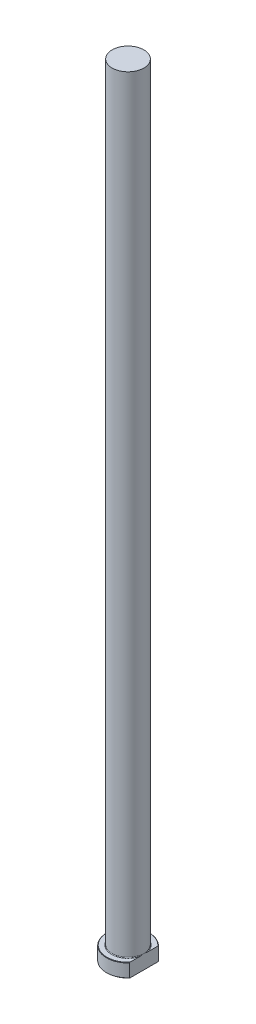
ISO-10303-21;
HEADER;
FILE_DESCRIPTION(('STEP AP214'),'2;1');
FILE_NAME('part.step','',(''),(''),'','','');
FILE_SCHEMA(('AUTOMOTIVE_DESIGN { 1 0 10303 214 1 1 1 1 }'));
ENDSEC;
DATA;
#1=APPLICATION_CONTEXT('core data for automotive mechanical design processes');
#2=APPLICATION_PROTOCOL_DEFINITION('international standard','automotive_design',2000,#1);
#3=PRODUCT_CONTEXT('',#1,'mechanical');
#4=PRODUCT('Part','Part','',(#3));
#5=PRODUCT_RELATED_PRODUCT_CATEGORY('part','',(#4));
#6=PRODUCT_DEFINITION_FORMATION('','',#4);
#7=PRODUCT_DEFINITION_CONTEXT('part definition',#1,'design');
#8=PRODUCT_DEFINITION('design','',#6,#7);
#9=PRODUCT_DEFINITION_SHAPE('','',#8);
#10=(LENGTH_UNIT() NAMED_UNIT(*) SI_UNIT(.MILLI.,.METRE.));
#11=(NAMED_UNIT(*) PLANE_ANGLE_UNIT() SI_UNIT($,.RADIAN.));
#12=(NAMED_UNIT(*) SI_UNIT($,.STERADIAN.) SOLID_ANGLE_UNIT());
#13=UNCERTAINTY_MEASURE_WITH_UNIT(LENGTH_MEASURE(1.E-05),#10,'distance_accuracy_value','');
#14=(GEOMETRIC_REPRESENTATION_CONTEXT(3) GLOBAL_UNCERTAINTY_ASSIGNED_CONTEXT((#13)) GLOBAL_UNIT_ASSIGNED_CONTEXT((#10,
#11,#12)) REPRESENTATION_CONTEXT('',''));
#15=CARTESIAN_POINT('',(0.,0.,0.));
#16=DIRECTION('',(0.,0.,1.));
#17=DIRECTION('',(1.,0.,0.));
#18=AXIS2_PLACEMENT_3D('',#15,#16,#17);
#19=CARTESIAN_POINT('',(0.,0.,0.));
#20=DIRECTION('',(0.,-1.,0.));
#21=DIRECTION('',(0.,0.,-1.));
#22=AXIS2_PLACEMENT_3D('',#19,#20,#21);
#23=PLANE('',#22);
#24=CARTESIAN_POINT('',(0.,0.,0.));
#25=DIRECTION('',(0.,-1.,0.));
#26=DIRECTION('',(0.,0.,-1.));
#27=AXIS2_PLACEMENT_3D('',#24,#25,#26);
#28=CIRCLE('',#27,10.7999999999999);
#29=CARTESIAN_POINT('',(8.09999999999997,0.,7.14352853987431));
#30=VERTEX_POINT('',#29);
#31=CARTESIAN_POINT('',(8.09999999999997,0.,-7.14352853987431));
#32=VERTEX_POINT('',#31);
#33=EDGE_CURVE('E98',#30,#32,#28,.T.);
#34=ORIENTED_EDGE('',*,*,#33,.T.);
#35=DIRECTION('',(0.,0.,1.));
#36=VECTOR('',#35,1.);
#37=CARTESIAN_POINT('',(8.09999999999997,0.,-7.44244583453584));
#38=LINE('',#37,#36);
#39=EDGE_CURVE('E83',#32,#30,#38,.T.);
#40=ORIENTED_EDGE('',*,*,#39,.T.);
#41=EDGE_LOOP('',(#34,#40));
#42=FACE_BOUND('',#41,.T.);
#43=ADVANCED_FACE('F32',(#42),#23,.T.);
#44=CARTESIAN_POINT('',(0.,259.958771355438,0.));
#45=DIRECTION('',(0.,1.,0.));
#46=DIRECTION('',(0.,0.,1.));
#47=AXIS2_PLACEMENT_3D('',#44,#45,#46);
#48=CYLINDRICAL_SURFACE('',#47,11.);
#49=CARTESIAN_POINT('',(0.,6.79999999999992,0.));
#50=DIRECTION('',(0.,1.,0.));
#51=DIRECTION('',(0.,0.,1.));
#52=AXIS2_PLACEMENT_3D('',#49,#50,#51);
#53=CIRCLE('',#52,11.);
#54=CARTESIAN_POINT('',(8.09999999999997,6.79999999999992,7.44244583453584));
#55=VERTEX_POINT('',#54);
#56=CARTESIAN_POINT('',(8.09999999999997,6.79999999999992,-7.44244583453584));
#57=VERTEX_POINT('',#56);
#58=EDGE_CURVE('E104',#55,#57,#53,.F.);
#59=ORIENTED_EDGE('',*,*,#58,.T.);
#60=DIRECTION('',(0.,-1.,0.));
#61=VECTOR('',#60,1.);
#62=CARTESIAN_POINT('',(8.09999999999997,400.,-7.44244583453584));
#63=LINE('',#62,#61);
#64=CARTESIAN_POINT('',(8.09999999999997,0.200000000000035,-7.44244583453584));
#65=VERTEX_POINT('',#64);
#66=EDGE_CURVE('E183',#57,#65,#63,.T.);
#67=ORIENTED_EDGE('',*,*,#66,.T.);
#68=CARTESIAN_POINT('',(0.,0.200000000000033,0.));
#69=DIRECTION('',(0.,-1.,0.));
#70=DIRECTION('',(0.,0.,-1.));
#71=AXIS2_PLACEMENT_3D('',#68,#69,#70);
#72=CIRCLE('',#71,11.);
#73=CARTESIAN_POINT('',(8.09999999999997,0.200000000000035,7.44244583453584));
#74=VERTEX_POINT('',#73);
#75=EDGE_CURVE('E100',#65,#74,#72,.F.);
#76=ORIENTED_EDGE('',*,*,#75,.T.);
#77=DIRECTION('',(0.,-1.,0.));
#78=VECTOR('',#77,1.);
#79=CARTESIAN_POINT('',(8.09999999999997,400.,7.44244583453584));
#80=LINE('',#79,#78);
#81=EDGE_CURVE('E93',#55,#74,#80,.T.);
#82=ORIENTED_EDGE('',*,*,#81,.F.);
#83=EDGE_LOOP('',(#59,#67,#76,#82));
#84=FACE_BOUND('',#83,.T.);
#85=ADVANCED_FACE('F158',(#84),#48,.T.);
#86=CARTESIAN_POINT('',(-11.,7.,0.));
#87=DIRECTION('',(0.,1.,0.));
#88=DIRECTION('',(0.,0.,1.));
#89=AXIS2_PLACEMENT_3D('',#86,#87,#88);
#90=PLANE('',#89);
#91=CARTESIAN_POINT('',(0.,7.,0.));
#92=DIRECTION('',(0.,1.,0.));
#93=DIRECTION('',(0.,0.,1.));
#94=AXIS2_PLACEMENT_3D('',#91,#92,#93);
#95=CIRCLE('',#94,10.7999999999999);
#96=CARTESIAN_POINT('',(8.09999999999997,7.,-7.14352853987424));
#97=VERTEX_POINT('',#96);
#98=CARTESIAN_POINT('',(8.09999999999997,7.,7.14352853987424));
#99=VERTEX_POINT('',#98);
#100=EDGE_CURVE('E178',#97,#99,#95,.T.);
#101=ORIENTED_EDGE('',*,*,#100,.T.);
#102=DIRECTION('',(0.,0.,-1.));
#103=VECTOR('',#102,1.);
#104=CARTESIAN_POINT('',(8.09999999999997,7.,0.));
#105=LINE('',#104,#103);
#106=CARTESIAN_POINT('',(8.09999999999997,6.99999999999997,2.22485954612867));
#107=VERTEX_POINT('',#106);
#108=EDGE_CURVE('E57',#99,#107,#105,.T.);
#109=ORIENTED_EDGE('',*,*,#108,.T.);
#110=CARTESIAN_POINT('',(0.,7.,0.));
#111=DIRECTION('',(0.,1.,0.));
#112=DIRECTION('',(0.,0.,1.));
#113=AXIS2_PLACEMENT_3D('',#110,#111,#112);
#114=CIRCLE('',#113,8.39999999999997);
#115=CARTESIAN_POINT('',(8.09999999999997,6.99999999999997,-2.22485954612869));
#116=VERTEX_POINT('',#115);
#117=EDGE_CURVE('E107',#107,#116,#114,.F.);
#118=ORIENTED_EDGE('',*,*,#117,.T.);
#119=EDGE_CURVE('E136',#116,#97,#105,.T.);
#120=ORIENTED_EDGE('',*,*,#119,.T.);
#121=EDGE_LOOP('',(#101,#109,#118,#120));
#122=FACE_BOUND('',#121,.T.);
#123=ADVANCED_FACE('F147',(#122),#90,.T.);
#124=CARTESIAN_POINT('',(0.,7.00000000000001,0.));
#125=DIRECTION('',(0.,-1.,0.));
#126=DIRECTION('',(0.,0.,-1.));
#127=AXIS2_PLACEMENT_3D('',#124,#125,#126);
#128=CONICAL_SURFACE('',#127,10.7999999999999,0.785398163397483);
#129=ORIENTED_EDGE('',*,*,#58,.F.);
#130=CARTESIAN_POINT('',(8.09999999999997,-0.468293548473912,16.3743869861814));
#131=CARTESIAN_POINT('',(8.09999999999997,-0.254363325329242,16.1357074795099));
#132=CARTESIAN_POINT('',(8.09999999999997,-0.0409370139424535,15.8965760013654));
#133=CARTESIAN_POINT('',(8.09999999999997,0.384762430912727,15.417284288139));
#134=CARTESIAN_POINT('',(8.09999999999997,0.597035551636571,15.1771240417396));
#135=CARTESIAN_POINT('',(8.09999999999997,1.23203735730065,14.4547646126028));
#136=CARTESIAN_POINT('',(8.09999999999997,1.65280946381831,13.9708414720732));
#137=CARTESIAN_POINT('',(8.09999999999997,2.49198203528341,12.9919134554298));
#138=CARTESIAN_POINT('',(8.09999999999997,2.91030911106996,12.4968454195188));
#139=CARTESIAN_POINT('',(8.09999999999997,3.53063151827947,11.7483710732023));
#140=CARTESIAN_POINT('',(8.09999999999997,3.73619473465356,11.4979212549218));
#141=CARTESIAN_POINT('',(8.09999999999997,4.14450356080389,10.9947372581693));
#142=CARTESIAN_POINT('',(8.09999999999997,4.3472492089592,10.7420031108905));
#143=CARTESIAN_POINT('',(8.09999999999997,4.73433340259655,10.2529152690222));
#144=CARTESIAN_POINT('',(8.09999999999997,4.91891315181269,10.0167526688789));
#145=CARTESIAN_POINT('',(8.09999999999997,5.28467709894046,9.54181650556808));
#146=CARTESIAN_POINT('',(8.09999999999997,5.4658613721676,9.30304300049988));
#147=CARTESIAN_POINT('',(8.09999999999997,5.82427381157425,8.8223405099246));
#148=CARTESIAN_POINT('',(8.09999999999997,6.00149981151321,8.58040990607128));
#149=CARTESIAN_POINT('',(8.09999999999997,6.35105499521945,8.0930332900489));
#150=CARTESIAN_POINT('',(8.09999999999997,6.52338425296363,7.84758733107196));
#151=CARTESIAN_POINT('',(8.09999999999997,6.86170981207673,7.35313784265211));
#152=CARTESIAN_POINT('',(8.09999999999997,7.02771904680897,7.10414319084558));
#153=CARTESIAN_POINT('',(8.09999999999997,7.35243924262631,6.6013915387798));
#154=CARTESIAN_POINT('',(8.09999999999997,7.51114961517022,6.34763415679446));
#155=CARTESIAN_POINT('',(8.09999999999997,7.81934238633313,5.83485140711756));
#156=CARTESIAN_POINT('',(8.09999999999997,7.96883276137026,5.57583085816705));
#157=CARTESIAN_POINT('',(8.09999999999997,8.25640202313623,5.05156426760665));
#158=CARTESIAN_POINT('',(8.09999999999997,8.39448364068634,4.7863197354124));
#159=CARTESIAN_POINT('',(8.09999999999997,8.64733540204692,4.26720676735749));
#160=CARTESIAN_POINT('',(8.09999999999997,8.76305451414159,4.01380392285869));
#161=CARTESIAN_POINT('',(8.09999999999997,8.97906757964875,3.50043611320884));
#162=CARTESIAN_POINT('',(8.09999999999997,9.07936141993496,3.24047109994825));
#163=CARTESIAN_POINT('',(8.09999999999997,9.26061269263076,2.71507213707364));
#164=CARTESIAN_POINT('',(8.09999999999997,9.34165272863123,2.4496670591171));
#165=CARTESIAN_POINT('',(8.09999999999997,9.48121180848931,1.91293243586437));
#166=CARTESIAN_POINT('',(8.09999999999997,9.53973286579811,1.64160342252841));
#167=CARTESIAN_POINT('',(8.09999999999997,9.63162156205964,1.08977238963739));
#168=CARTESIAN_POINT('',(8.09999999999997,9.66453368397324,0.809192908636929));
#169=CARTESIAN_POINT('',(8.09999999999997,9.70112845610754,0.246139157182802));
#170=CARTESIAN_POINT('',(8.09999999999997,9.70481576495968,-0.0363348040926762));
#171=CARTESIAN_POINT('',(8.09999999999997,9.68267265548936,-0.600479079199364));
#172=CARTESIAN_POINT('',(8.09999999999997,9.6568027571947,-0.882147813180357));
#173=CARTESIAN_POINT('',(8.09999999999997,9.57739238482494,-1.44154939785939));
#174=CARTESIAN_POINT('',(8.09999999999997,9.52384373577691,-1.71928106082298));
#175=CARTESIAN_POINT('',(8.09999999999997,9.37717365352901,-2.3328661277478));
#176=CARTESIAN_POINT('',(8.09999999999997,9.27774098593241,-2.66719445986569));
#177=CARTESIAN_POINT('',(8.09999999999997,9.04935963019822,-3.32555561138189));
#178=CARTESIAN_POINT('',(8.09999999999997,8.92039733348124,-3.64958360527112));
#179=CARTESIAN_POINT('',(8.09999999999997,8.7090765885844,-4.12987142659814));
#180=CARTESIAN_POINT('',(8.09999999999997,8.63516457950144,-4.28993932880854));
#181=CARTESIAN_POINT('',(8.09999999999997,8.48223226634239,-4.60762322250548));
#182=CARTESIAN_POINT('',(8.09999999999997,8.40321193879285,-4.76523920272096));
#183=CARTESIAN_POINT('',(8.09999999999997,8.24075032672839,-5.07810202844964));
#184=CARTESIAN_POINT('',(8.09999999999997,8.15731046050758,-5.23334961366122));
#185=CARTESIAN_POINT('',(8.09999999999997,7.98654878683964,-5.54168695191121));
#186=CARTESIAN_POINT('',(8.09999999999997,7.89922702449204,-5.69477672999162));
#187=CARTESIAN_POINT('',(8.09999999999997,7.66338960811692,-6.09772881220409));
#188=CARTESIAN_POINT('',(8.09999999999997,7.51195498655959,-6.34588392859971));
#189=CARTESIAN_POINT('',(8.09999999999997,7.20164049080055,-6.83751069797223));
#190=CARTESIAN_POINT('',(8.09999999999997,7.04275963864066,-7.08098172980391));
#191=CARTESIAN_POINT('',(8.09999999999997,6.71886431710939,-7.56397194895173));
#192=CARTESIAN_POINT('',(8.09999999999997,6.55384686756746,-7.80348913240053));
#193=CARTESIAN_POINT('',(8.09999999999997,6.21883875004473,-8.27899456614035));
#194=CARTESIAN_POINT('',(8.09999999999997,6.04884829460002,-8.51498296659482));
#195=CARTESIAN_POINT('',(8.09999999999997,5.70426867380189,-8.98455504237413));
#196=CARTESIAN_POINT('',(8.09999999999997,5.52966831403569,-9.21813048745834));
#197=CARTESIAN_POINT('',(8.09999999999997,5.17697958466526,-9.68263613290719));
#198=CARTESIAN_POINT('',(8.09999999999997,4.99889113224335,-9.91356627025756));
#199=CARTESIAN_POINT('',(8.09999999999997,4.46033384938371,-10.6027922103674));
#200=CARTESIAN_POINT('',(8.09999999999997,4.09547364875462,-11.0576577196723));
#201=CARTESIAN_POINT('',(8.09999999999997,3.38639212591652,-11.9247254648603));
#202=CARTESIAN_POINT('',(8.09999999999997,3.04281718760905,-12.3374594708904));
#203=CARTESIAN_POINT('',(8.09999999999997,2.3500551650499,-13.1582374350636));
#204=CARTESIAN_POINT('',(8.09999999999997,2.00086766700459,-13.5662810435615));
#205=CARTESIAN_POINT('',(8.09999999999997,1.30027764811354,-14.3760884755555));
#206=CARTESIAN_POINT('',(8.09999999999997,0.948901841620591,-14.7778754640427));
#207=CARTESIAN_POINT('',(8.09999999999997,0.242699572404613,-15.5783083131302));
#208=CARTESIAN_POINT('',(8.09999999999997,-0.112126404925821,-15.9769546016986));
#209=CARTESIAN_POINT('',(8.09999999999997,-0.468293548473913,-16.3743869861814));
#210=B_SPLINE_CURVE_WITH_KNOTS('',3,(#130,#131,#132,#133,#134,#135,#136,#137,#138,#139,#140,
#141,#142,#143,#144,#145,#146,#147,#148,#149,#150,#151,#152,#153,#154,#155,#156,#157,#158,#159,
#160,#161,#162,#163,#164,#165,#166,#167,#168,#169,#170,#171,#172,#173,#174,#175,#176,#177,#178,
#179,#180,#181,#182,#183,#184,#185,#186,#187,#188,#189,#190,#191,#192,#193,#194,#195,#196,#197,
#198,#199,#200,#201,#202,#203,#204,#205,#206,#207,#208,#209),.UNSPECIFIED.,.F.,.F.,(4,2,2,2,2,2,
2,2,2,2,2,2,2,2,2,2,2,2,2,2,2,2,2,2,2,2,2,2,2,2,2,2,2,2,2,2,2,2,2,4),(0.,0.961563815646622,
1.92313823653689,3.84691108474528,5.79124096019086,6.76324981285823,7.73524541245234,
8.63443178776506,9.53359819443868,10.4332451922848,11.3328785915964,12.2305594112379,
13.128312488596,14.0252776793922,14.9220275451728,15.7573406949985,16.5926599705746,
17.4243280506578,18.2559217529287,19.1019891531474,19.9479216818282,20.7949854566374,
21.6422995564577,22.6869149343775,23.7320126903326,24.2608671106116,24.7897239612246,
25.3184121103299,25.8470941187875,26.7190513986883,27.5911235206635,28.4636248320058,
29.3360889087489,30.2109126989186,31.085757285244,32.8349455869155,34.4459592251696,
36.0570921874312,37.6583452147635,39.2593761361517),.UNSPECIFIED.);
#211=EDGE_CURVE('E135',#55,#99,#210,.T.);
#212=ORIENTED_EDGE('',*,*,#211,.T.);
#213=ORIENTED_EDGE('',*,*,#100,.F.);
#214=EDGE_CURVE('E127',#97,#57,#210,.T.);
#215=ORIENTED_EDGE('',*,*,#214,.T.);
#216=EDGE_LOOP('',(#129,#212,#213,#215));
#217=FACE_BOUND('',#216,.T.);
#218=ADVANCED_FACE('F143',(#217),#128,.T.);
#219=CARTESIAN_POINT('',(0.,0.200000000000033,0.));
#220=DIRECTION('',(0.,1.,0.));
#221=DIRECTION('',(0.,0.,1.));
#222=AXIS2_PLACEMENT_3D('',#219,#220,#221);
#223=CONICAL_SURFACE('',#222,11.,0.785398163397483);
#224=ORIENTED_EDGE('',*,*,#75,.F.);
#225=CARTESIAN_POINT('',(8.09999999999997,7.46829354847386,-16.3743869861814));
#226=CARTESIAN_POINT('',(8.09999999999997,7.25436332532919,-16.1357074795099));
#227=CARTESIAN_POINT('',(8.09999999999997,7.0409370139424,-15.8965760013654));
#228=CARTESIAN_POINT('',(8.09999999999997,6.61523756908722,-15.417284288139));
#229=CARTESIAN_POINT('',(8.09999999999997,6.40296444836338,-15.1771240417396));
#230=CARTESIAN_POINT('',(8.09999999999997,5.7679626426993,-14.4547646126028));
#231=CARTESIAN_POINT('',(8.09999999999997,5.34719053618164,-13.9708414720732));
#232=CARTESIAN_POINT('',(8.09999999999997,4.50801796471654,-12.9919134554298));
#233=CARTESIAN_POINT('',(8.09999999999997,4.08969088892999,-12.4968454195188));
#234=CARTESIAN_POINT('',(8.09999999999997,3.46936848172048,-11.7483710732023));
#235=CARTESIAN_POINT('',(8.09999999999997,3.26380526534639,-11.4979212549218));
#236=CARTESIAN_POINT('',(8.09999999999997,2.85549643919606,-10.9947372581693));
#237=CARTESIAN_POINT('',(8.09999999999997,2.65275079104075,-10.7420031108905));
#238=CARTESIAN_POINT('',(8.09999999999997,2.26566659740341,-10.2529152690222));
#239=CARTESIAN_POINT('',(8.09999999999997,2.08108684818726,-10.0167526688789));
#240=CARTESIAN_POINT('',(8.09999999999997,1.71532290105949,-9.54181650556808));
#241=CARTESIAN_POINT('',(8.09999999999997,1.53413862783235,-9.30304300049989));
#242=CARTESIAN_POINT('',(8.09999999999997,1.1757261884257,-8.8223405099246));
#243=CARTESIAN_POINT('',(8.09999999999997,0.998500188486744,-8.58040990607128));
#244=CARTESIAN_POINT('',(8.09999999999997,0.648945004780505,-8.09303329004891));
#245=CARTESIAN_POINT('',(8.09999999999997,0.476615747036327,-7.84758733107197));
#246=CARTESIAN_POINT('',(8.09999999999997,0.138290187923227,-7.35313784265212));
#247=CARTESIAN_POINT('',(8.09999999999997,-0.0277190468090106,-7.10414319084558));
#248=CARTESIAN_POINT('',(8.09999999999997,-0.352439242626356,-6.60139153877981));
#249=CARTESIAN_POINT('',(8.09999999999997,-0.511149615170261,-6.34763415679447));
#250=CARTESIAN_POINT('',(8.09999999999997,-0.819342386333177,-5.83485140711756));
#251=CARTESIAN_POINT('',(8.09999999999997,-0.968832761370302,-5.57583085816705));
#252=CARTESIAN_POINT('',(8.09999999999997,-1.25640202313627,-5.05156426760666));
#253=CARTESIAN_POINT('',(8.09999999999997,-1.39448364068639,-4.78631973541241));
#254=CARTESIAN_POINT('',(8.09999999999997,-1.64733540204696,-4.26720676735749));
#255=CARTESIAN_POINT('',(8.09999999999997,-1.76305451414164,-4.0138039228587));
#256=CARTESIAN_POINT('',(8.09999999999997,-1.97906757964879,-3.50043611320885));
#257=CARTESIAN_POINT('',(8.09999999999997,-2.079361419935,-3.24047109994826));
#258=CARTESIAN_POINT('',(8.09999999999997,-2.26061269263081,-2.71507213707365));
#259=CARTESIAN_POINT('',(8.09999999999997,-2.34165272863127,-2.44966705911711));
#260=CARTESIAN_POINT('',(8.09999999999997,-2.48121180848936,-1.91293243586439));
#261=CARTESIAN_POINT('',(8.09999999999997,-2.53973286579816,-1.64160342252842));
#262=CARTESIAN_POINT('',(8.09999999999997,-2.63162156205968,-1.0897723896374));
#263=CARTESIAN_POINT('',(8.09999999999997,-2.66453368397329,-0.80919290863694));
#264=CARTESIAN_POINT('',(8.09999999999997,-2.70112845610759,-0.246139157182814));
#265=CARTESIAN_POINT('',(8.09999999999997,-2.70481576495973,0.0363348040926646));
#266=CARTESIAN_POINT('',(8.09999999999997,-2.68267265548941,0.600479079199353));
#267=CARTESIAN_POINT('',(8.09999999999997,-2.65680275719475,0.882147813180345));
#268=CARTESIAN_POINT('',(8.09999999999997,-2.57739238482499,1.44154939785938));
#269=CARTESIAN_POINT('',(8.09999999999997,-2.52384373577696,1.71928106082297));
#270=CARTESIAN_POINT('',(8.09999999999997,-2.37717365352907,2.33286612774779));
#271=CARTESIAN_POINT('',(8.09999999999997,-2.27774098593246,2.66719445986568));
#272=CARTESIAN_POINT('',(8.09999999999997,-2.04935963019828,3.32555561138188));
#273=CARTESIAN_POINT('',(8.09999999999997,-1.92039733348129,3.64958360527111));
#274=CARTESIAN_POINT('',(8.09999999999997,-1.70907658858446,4.12987142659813));
#275=CARTESIAN_POINT('',(8.09999999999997,-1.63516457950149,4.28993932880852));
#276=CARTESIAN_POINT('',(8.09999999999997,-1.48223226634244,4.60762322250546));
#277=CARTESIAN_POINT('',(8.09999999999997,-1.4032119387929,4.76523920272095));
#278=CARTESIAN_POINT('',(8.09999999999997,-1.24075032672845,5.07810202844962));
#279=CARTESIAN_POINT('',(8.09999999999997,-1.15731046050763,5.23334961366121));
#280=CARTESIAN_POINT('',(8.09999999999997,-0.986548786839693,5.5416869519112));
#281=CARTESIAN_POINT('',(8.09999999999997,-0.899227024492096,5.69477672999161));
#282=CARTESIAN_POINT('',(8.09999999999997,-0.663389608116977,6.09772881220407));
#283=CARTESIAN_POINT('',(8.09999999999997,-0.511954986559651,6.3458839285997));
#284=CARTESIAN_POINT('',(8.09999999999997,-0.201640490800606,6.83751069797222));
#285=CARTESIAN_POINT('',(8.09999999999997,-0.0427596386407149,7.0809817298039));
#286=CARTESIAN_POINT('',(8.09999999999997,0.281135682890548,7.56397194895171));
#287=CARTESIAN_POINT('',(8.09999999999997,0.446153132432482,7.80348913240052));
#288=CARTESIAN_POINT('',(8.09999999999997,0.781161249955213,8.27899456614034));
#289=CARTESIAN_POINT('',(8.09999999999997,0.951151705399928,8.51498296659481));
#290=CARTESIAN_POINT('',(8.09999999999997,1.29573132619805,8.98455504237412));
#291=CARTESIAN_POINT('',(8.09999999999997,1.47033168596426,9.21813048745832));
#292=CARTESIAN_POINT('',(8.09999999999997,1.82302041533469,9.68263613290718));
#293=CARTESIAN_POINT('',(8.09999999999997,2.00110886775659,9.91356627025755));
#294=CARTESIAN_POINT('',(8.09999999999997,2.53966615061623,10.6027922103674));
#295=CARTESIAN_POINT('',(8.09999999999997,2.90452635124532,11.0576577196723));
#296=CARTESIAN_POINT('',(8.09999999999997,3.61360787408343,11.9247254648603));
#297=CARTESIAN_POINT('',(8.09999999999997,3.9571828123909,12.3374594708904));
#298=CARTESIAN_POINT('',(8.09999999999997,4.64994483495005,13.1582374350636));
#299=CARTESIAN_POINT('',(8.09999999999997,4.99913233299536,13.5662810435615));
#300=CARTESIAN_POINT('',(8.09999999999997,5.69972235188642,14.3760884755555));
#301=CARTESIAN_POINT('',(8.09999999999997,6.05109815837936,14.7778754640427));
#302=CARTESIAN_POINT('',(8.09999999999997,6.75730042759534,15.5783083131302));
#303=CARTESIAN_POINT('',(8.09999999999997,7.11212640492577,15.9769546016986));
#304=CARTESIAN_POINT('',(8.09999999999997,7.46829354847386,16.3743869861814));
#305=B_SPLINE_CURVE_WITH_KNOTS('',3,(#225,#226,#227,#228,#229,#230,#231,#232,#233,#234,#235,
#236,#237,#238,#239,#240,#241,#242,#243,#244,#245,#246,#247,#248,#249,#250,#251,#252,#253,#254,
#255,#256,#257,#258,#259,#260,#261,#262,#263,#264,#265,#266,#267,#268,#269,#270,#271,#272,#273,
#274,#275,#276,#277,#278,#279,#280,#281,#282,#283,#284,#285,#286,#287,#288,#289,#290,#291,#292,
#293,#294,#295,#296,#297,#298,#299,#300,#301,#302,#303,#304),.UNSPECIFIED.,.F.,.F.,(4,2,2,2,2,2,
2,2,2,2,2,2,2,2,2,2,2,2,2,2,2,2,2,2,2,2,2,2,2,2,2,2,2,2,2,2,2,2,2,4),(0.,0.961563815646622,
1.92313823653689,3.84691108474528,5.79124096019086,6.76324981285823,7.73524541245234,
8.63443178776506,9.53359819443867,10.4332451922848,11.3328785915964,12.2305594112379,
13.1283124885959,14.0252776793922,14.9220275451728,15.7573406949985,16.5926599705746,
17.4243280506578,18.2559217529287,19.1019891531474,19.9479216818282,20.7949854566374,
21.6422995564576,22.6869149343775,23.7320126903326,24.2608671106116,24.7897239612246,
25.3184121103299,25.8470941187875,26.7190513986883,27.5911235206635,28.4636248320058,
29.3360889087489,30.2109126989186,31.085757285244,32.8349455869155,34.4459592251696,
36.0570921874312,37.6583452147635,39.2593761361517),.UNSPECIFIED.);
#306=EDGE_CURVE('E86',#65,#32,#305,.T.);
#307=ORIENTED_EDGE('',*,*,#306,.T.);
#308=ORIENTED_EDGE('',*,*,#33,.F.);
#309=EDGE_CURVE('E89',#30,#74,#305,.T.);
#310=ORIENTED_EDGE('',*,*,#309,.T.);
#311=EDGE_LOOP('',(#224,#307,#308,#310));
#312=FACE_BOUND('',#311,.T.);
#313=ADVANCED_FACE('F97',(#312),#223,.T.);
#314=CARTESIAN_POINT('',(0.,7.29999999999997,0.));
#315=DIRECTION('',(0.,1.,0.));
#316=DIRECTION('',(0.,0.,1.));
#317=AXIS2_PLACEMENT_3D('',#314,#315,#316);
#318=TOROIDAL_SURFACE('',#317,8.39999999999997,0.3);
#319=CARTESIAN_POINT('',(8.09999999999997,7.29999999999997,0.));
#320=CARTESIAN_POINT('',(8.09999999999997,7.30000062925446,1.10217513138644E-10));
#321=CARTESIAN_POINT('',(8.09999999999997,7.30000125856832,-3.48372532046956E-07));
#322=CARTESIAN_POINT('',(8.09999999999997,7.30000242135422,-1.24325315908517E-06));
#323=CARTESIAN_POINT('',(8.09999999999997,7.30000291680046,-1.81407064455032E-06));
#324=CARTESIAN_POINT('',(8.09999999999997,7.30000399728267,-3.20556588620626E-06));
#325=CARTESIAN_POINT('',(8.09999999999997,7.30000456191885,-4.04857468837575E-06));
#326=CARTESIAN_POINT('',(8.09999999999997,7.30000552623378,-5.7486288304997E-06));
#327=CARTESIAN_POINT('',(8.09999999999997,7.30000593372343,-6.60186051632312E-06));
#328=CARTESIAN_POINT('',(8.09999999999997,7.30000755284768,-1.00751095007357E-05));
#329=CARTESIAN_POINT('',(8.09999999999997,7.30000870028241,-1.27308878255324E-05));
#330=CARTESIAN_POINT('',(8.09999999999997,7.30001048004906,-1.78566813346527E-05));
#331=CARTESIAN_POINT('',(8.09999999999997,7.30001115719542,-2.03116208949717E-05));
#332=CARTESIAN_POINT('',(8.09999999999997,7.30001416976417,-3.11399264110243E-05));
#333=CARTESIAN_POINT('',(8.09999999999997,7.30001656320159,-3.94979192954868E-05));
#334=CARTESIAN_POINT('',(8.09999999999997,7.30001991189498,-5.49761459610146E-05));
#335=CARTESIAN_POINT('',(8.09999999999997,7.30002104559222,-6.20568593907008E-05));
#336=CARTESIAN_POINT('',(8.09999999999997,7.30002955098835,-0.000115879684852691));
#337=CARTESIAN_POINT('',(8.09999999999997,7.30003630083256,-0.00016266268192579));
#338=CARTESIAN_POINT('',(8.09999999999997,7.30006581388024,-0.000349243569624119));
#339=CARTESIAN_POINT('',(8.09999999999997,7.30009364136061,-0.000488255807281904));
#340=CARTESIAN_POINT('',(8.09999999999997,7.30020321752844,-0.00104344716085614));
#341=CARTESIAN_POINT('',(8.09999999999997,7.30028192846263,-0.00145999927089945));
#342=CARTESIAN_POINT('',(8.09999999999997,7.30059961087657,-0.00313052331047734));
#343=CARTESIAN_POINT('',(8.09999999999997,7.30084255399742,-0.0043839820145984));
#344=CARTESIAN_POINT('',(8.09999999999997,7.30186079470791,-0.00964975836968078));
#345=CARTESIAN_POINT('',(8.09999999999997,7.30263102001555,-0.0136627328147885));
#346=CARTESIAN_POINT('',(8.09999999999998,7.30867561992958,-0.045139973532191));
#347=CARTESIAN_POINT('',(8.09999999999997,7.31396742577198,-0.0726020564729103));
#348=CARTESIAN_POINT('',(8.09999999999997,7.32431115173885,-0.126405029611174));
#349=CARTESIAN_POINT('',(8.09999999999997,7.32936401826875,-0.152745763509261));
#350=CARTESIAN_POINT('',(8.09999999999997,7.34587210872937,-0.238985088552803));
#351=CARTESIAN_POINT('',(8.09999999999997,7.35728443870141,-0.298892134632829));
#352=CARTESIAN_POINT('',(8.09999999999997,7.37648902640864,-0.400785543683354));
#353=CARTESIAN_POINT('',(8.09999999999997,7.38434094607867,-0.442760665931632));
#354=CARTESIAN_POINT('',(8.09999999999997,7.39967591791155,-0.525583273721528));
#355=CARTESIAN_POINT('',(8.09999999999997,7.40716317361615,-0.566429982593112));
#356=CARTESIAN_POINT('',(8.09999999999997,7.43255561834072,-0.706751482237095));
#357=CARTESIAN_POINT('',(8.09999999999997,7.45000488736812,-0.806310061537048));
#358=CARTESIAN_POINT('',(8.09999999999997,7.48336031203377,-1.00668681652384));
#359=CARTESIAN_POINT('',(8.09999999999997,7.49924974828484,-1.10750780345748));
#360=CARTESIAN_POINT('',(8.09999999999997,7.53002321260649,-1.31956600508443));
#361=CARTESIAN_POINT('',(8.09999999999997,7.5446499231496,-1.43084155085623));
#362=CARTESIAN_POINT('',(8.09999999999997,7.56967383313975,-1.65357260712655));
#363=CARTESIAN_POINT('',(8.09999999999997,7.58008243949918,-1.76502680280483));
#364=CARTESIAN_POINT('',(8.09999999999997,7.59481704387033,-1.98455781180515));
#365=CARTESIAN_POINT('',(8.09999999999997,7.59933894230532,-2.09261973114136));
#366=CARTESIAN_POINT('',(8.09999999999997,7.6002232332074,-2.25365680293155));
#367=CARTESIAN_POINT('',(8.09999999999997,7.59957115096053,-2.30661427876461));
#368=CARTESIAN_POINT('',(8.09999999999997,7.59593025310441,-2.41243717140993));
#369=CARTESIAN_POINT('',(8.09999999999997,7.59294242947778,-2.46530261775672));
#370=CARTESIAN_POINT('',(8.09999999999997,7.58438337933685,-2.56626617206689));
#371=CARTESIAN_POINT('',(8.09999999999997,7.57905558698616,-2.61438444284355));
#372=CARTESIAN_POINT('',(8.09999999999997,7.56511668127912,-2.71063967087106));
#373=CARTESIAN_POINT('',(8.09999999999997,7.55647540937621,-2.75877261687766));
#374=CARTESIAN_POINT('',(8.09999999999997,7.53997521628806,-2.83052401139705));
#375=CARTESIAN_POINT('',(8.09999999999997,7.5338289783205,-2.85453498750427));
#376=CARTESIAN_POINT('',(8.09999999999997,7.52005528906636,-2.90212319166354));
#377=CARTESIAN_POINT('',(8.09999999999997,7.51242879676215,-2.92570068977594));
#378=CARTESIAN_POINT('',(8.09999999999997,7.49534810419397,-2.97194486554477));
#379=CARTESIAN_POINT('',(8.09999999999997,7.48591141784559,-2.99461794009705));
#380=CARTESIAN_POINT('',(8.09999999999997,7.46452687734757,-3.0387244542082));
#381=CARTESIAN_POINT('',(8.09999999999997,7.4525885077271,-3.06016219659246));
#382=CARTESIAN_POINT('',(8.09999999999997,7.43211325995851,-3.09021268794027));
#383=CARTESIAN_POINT('',(8.09999999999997,7.42496972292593,-3.09976653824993));
#384=CARTESIAN_POINT('',(8.09999999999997,7.40960263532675,-3.11798598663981));
#385=CARTESIAN_POINT('',(8.09999999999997,7.40137953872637,-3.12665195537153));
#386=CARTESIAN_POINT('',(8.09999999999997,7.3859293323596,-3.14052845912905));
#387=CARTESIAN_POINT('',(8.09999999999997,7.37898924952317,-3.14605470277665));
#388=CARTESIAN_POINT('',(8.09999999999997,7.36434419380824,-3.15598943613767));
#389=CARTESIAN_POINT('',(8.09999999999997,7.35664068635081,-3.16040001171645));
#390=CARTESIAN_POINT('',(8.09999999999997,7.34254794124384,-3.16675602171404));
#391=CARTESIAN_POINT('',(8.09999999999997,7.33631410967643,-3.16904233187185));
#392=CARTESIAN_POINT('',(8.09999999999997,7.3235539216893,-3.17255113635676));
#393=CARTESIAN_POINT('',(8.09999999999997,7.31702793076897,-3.17377492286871));
#394=CARTESIAN_POINT('',(8.09999999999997,7.30382788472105,-3.17503459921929));
#395=CARTESIAN_POINT('',(8.09999999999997,7.29715327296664,-3.17506481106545));
#396=CARTESIAN_POINT('',(8.09999999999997,7.28390757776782,-3.1739190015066));
#397=CARTESIAN_POINT('',(8.09999999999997,7.27733655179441,-3.17274233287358));
#398=CARTESIAN_POINT('',(8.09999999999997,7.26486630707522,-3.16941116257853));
#399=CARTESIAN_POINT('',(8.09999999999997,7.25895027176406,-3.16731785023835));
#400=CARTESIAN_POINT('',(8.09999999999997,7.24746822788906,-3.16233639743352));
#401=CARTESIAN_POINT('',(8.09999999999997,7.24190232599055,-3.15944801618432));
#402=CARTESIAN_POINT('',(8.09999999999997,7.22717908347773,-3.15067054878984));
#403=CARTESIAN_POINT('',(8.09999999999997,7.21840505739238,-3.14414072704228));
#404=CARTESIAN_POINT('',(8.09999999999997,7.20193704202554,-3.129833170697));
#405=CARTESIAN_POINT('',(8.09999999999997,7.19424714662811,-3.12205093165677));
#406=CARTESIAN_POINT('',(8.09999999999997,7.17324842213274,-3.0982735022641));
#407=CARTESIAN_POINT('',(8.09999999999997,7.16115297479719,-3.08121965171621));
#408=CARTESIAN_POINT('',(8.09999999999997,7.13935274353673,-3.0457024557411));
#409=CARTESIAN_POINT('',(8.09999999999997,7.12965213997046,-3.02723671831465));
#410=CARTESIAN_POINT('',(8.09999999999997,7.10752548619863,-2.97992929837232));
#411=CARTESIAN_POINT('',(8.09999999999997,7.0962106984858,-2.95057306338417));
#412=CARTESIAN_POINT('',(8.09999999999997,7.07629636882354,-2.89093361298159));
#413=CARTESIAN_POINT('',(8.09999999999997,7.06770299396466,-2.86064846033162));
#414=CARTESIAN_POINT('',(8.09999999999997,7.05247262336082,-2.79917781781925));
#415=CARTESIAN_POINT('',(8.09999999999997,7.04586259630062,-2.76798573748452));
#416=CARTESIAN_POINT('',(8.09999999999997,7.03430884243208,-2.70534539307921));
#417=CARTESIAN_POINT('',(8.09999999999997,7.02936298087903,-2.67389751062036));
#418=CARTESIAN_POINT('',(8.09999999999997,7.01745043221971,-2.58601265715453));
#419=CARTESIAN_POINT('',(8.09999999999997,7.0119543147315,-2.52937710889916));
#420=CARTESIAN_POINT('',(8.09999999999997,7.00412918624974,-2.41587715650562));
#421=CARTESIAN_POINT('',(8.09999999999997,7.00180216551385,-2.35901263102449));
#422=CARTESIAN_POINT('',(8.09999999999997,6.99963684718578,-2.24502208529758));
#423=CARTESIAN_POINT('',(8.09999999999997,6.99980818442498,-2.18789590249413));
#424=CARTESIAN_POINT('',(8.09999999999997,7.00218365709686,-2.07368289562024));
#425=CARTESIAN_POINT('',(8.09999999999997,7.00438811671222,-2.01659607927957));
#426=CARTESIAN_POINT('',(8.09999999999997,7.01309255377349,-1.85323047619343));
#427=CARTESIAN_POINT('',(8.09999999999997,7.0216582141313,-1.74706244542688));
#428=CARTESIAN_POINT('',(8.09999999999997,7.04295526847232,-1.5351174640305));
#429=CARTESIAN_POINT('',(8.09999999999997,7.05568874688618,-1.42934073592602));
#430=CARTESIAN_POINT('',(8.09999999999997,7.08235098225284,-1.2318322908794));
#431=CARTESIAN_POINT('',(8.09999999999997,7.09591325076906,-1.14005018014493));
#432=CARTESIAN_POINT('',(8.09999999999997,7.12513315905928,-0.9542946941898));
#433=CARTESIAN_POINT('',(8.09999999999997,7.14083731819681,-0.860328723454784));
#434=CARTESIAN_POINT('',(8.09999999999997,7.16870636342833,-0.70016522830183));
#435=CARTESIAN_POINT('',(8.09999999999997,7.18055718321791,-0.633912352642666));
#436=CARTESIAN_POINT('',(8.09999999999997,7.20457571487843,-0.502251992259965));
#437=CARTESIAN_POINT('',(8.09999999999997,7.21673820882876,-0.436843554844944));
#438=CARTESIAN_POINT('',(8.09999999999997,7.2398995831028,-0.313742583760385));
#439=CARTESIAN_POINT('',(8.09999999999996,7.25086777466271,-0.256044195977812));
#440=CARTESIAN_POINT('',(8.09999999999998,7.27343224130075,-0.138123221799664));
#441=CARTESIAN_POINT('',(8.1,7.28503484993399,-0.0779017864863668));
#442=CARTESIAN_POINT('',(8.09999999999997,7.29737058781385,-0.0136537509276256));
#443=CARTESIAN_POINT('',(8.09999999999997,7.29814262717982,-0.00963182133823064));
#444=CARTESIAN_POINT('',(8.09999999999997,7.29916127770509,-0.00436406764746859));
#445=CARTESIAN_POINT('',(8.09999999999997,7.29940286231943,-0.00311759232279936));
#446=CARTESIAN_POINT('',(8.09999999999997,7.29971889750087,-0.00145572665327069));
#447=CARTESIAN_POINT('',(8.09999999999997,7.29979729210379,-0.00104084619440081));
#448=CARTESIAN_POINT('',(8.09999999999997,7.29990649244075,-0.000487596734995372));
#449=CARTESIAN_POINT('',(8.09999999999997,7.29993426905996,-0.000348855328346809));
#450=CARTESIAN_POINT('',(8.09999999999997,7.29996373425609,-0.000162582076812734));
#451=CARTESIAN_POINT('',(8.09999999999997,7.29997047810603,-0.000115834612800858));
#452=CARTESIAN_POINT('',(8.09999999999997,7.29997897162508,-6.20484364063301E-05));
#453=CARTESIAN_POINT('',(8.09999999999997,7.29998010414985,-5.49694536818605E-05));
#454=CARTESIAN_POINT('',(8.09999999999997,7.2999834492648,-3.94950080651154E-05));
#455=CARTESIAN_POINT('',(8.09999999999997,7.29998584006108,-3.11389816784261E-05));
#456=CARTESIAN_POINT('',(8.09999999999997,7.2999888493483,-2.03127732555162E-05));
#457=CARTESIAN_POINT('',(8.09999999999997,7.29998952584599,-1.78579621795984E-05));
#458=CARTESIAN_POINT('',(8.09999999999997,7.29999130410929,-1.27323428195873E-05));
#459=CARTESIAN_POINT('',(8.09999999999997,7.29999245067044,-1.00765914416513E-05));
#460=CARTESIAN_POINT('',(8.09999999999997,7.29999406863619,-6.60328060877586E-06));
#461=CARTESIAN_POINT('',(8.09999999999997,7.29999447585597,-5.74999364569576E-06));
#462=CARTESIAN_POINT('',(8.09999999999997,7.29999543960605,-4.04978039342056E-06));
#463=CARTESIAN_POINT('',(8.09999999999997,7.29999600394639,-3.2066645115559E-06));
#464=CARTESIAN_POINT('',(8.09999999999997,7.29999708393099,-1.81492874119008E-06));
#465=CARTESIAN_POINT('',(8.09999999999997,7.29999757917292,-1.24398865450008E-06));
#466=CARTESIAN_POINT('',(8.09999999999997,7.29999874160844,-3.48781227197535E-07));
#467=CARTESIAN_POINT('',(8.09999999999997,7.29999937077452,-1.10212428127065E-10));
#468=CARTESIAN_POINT('',(8.09999999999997,7.29999999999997,0.));
#469=B_SPLINE_CURVE_WITH_KNOTS('',3,(#319,#320,#321,#322,#323,#324,#325,#326,#327,#328,#329,
#330,#331,#332,#333,#334,#335,#336,#337,#338,#339,#340,#341,#342,#343,#344,#345,#346,#347,#348,
#349,#350,#351,#352,#353,#354,#355,#356,#357,#358,#359,#360,#361,#362,#363,#364,#365,#366,#367,
#368,#369,#370,#371,#372,#373,#374,#375,#376,#377,#378,#379,#380,#381,#382,#383,#384,#385,#386,
#387,#388,#389,#390,#391,#392,#393,#394,#395,#396,#397,#398,#399,#400,#401,#402,#403,#404,#405,
#406,#407,#408,#409,#410,#411,#412,#413,#414,#415,#416,#417,#418,#419,#420,#421,#422,#423,#424,
#425,#426,#427,#428,#429,#430,#431,#432,#433,#434,#435,#436,#437,#438,#439,#440,#441,#442,#443,
#444,#445,#446,#447,#448,#449,#450,#451,#452,#453,#454,#455,#456,#457,#458,#459,#460,#461,#462,
#463,#464,#465,#466,#467,#468),.UNSPECIFIED.,.T.,.F.,(4,2,2,2,2,2,2,2,2,2,2,2,2,2,2,2,2,2,2,2,2,
2,2,2,2,2,2,2,2,2,2,2,2,2,2,2,2,2,2,2,2,2,2,2,2,2,2,2,2,2,2,2,2,2,2,2,2,2,2,2,2,2,2,2,2,2,2,2,2,
2,2,2,2,2,4),(0.,1.94566340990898E-06,4.24386131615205E-06,7.26038347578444E-06,
1.00975804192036E-05,1.87517574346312E-05,2.63844155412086E-05,5.24378709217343E-05,
7.39294306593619E-05,0.000215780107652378,0.000640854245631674,0.00191288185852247,
0.00574292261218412,0.0180019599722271,0.101902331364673,0.182365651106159,0.365318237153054,
0.493427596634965,0.618009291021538,0.921227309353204,1.22740416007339,1.56404340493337,
1.89976611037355,2.22400400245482,2.38285103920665,2.54163065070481,2.68679810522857,
2.83331946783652,2.90764122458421,2.98191499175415,3.05550342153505,3.12881774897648,
3.16455086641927,3.2002690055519,3.22680903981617,3.25329908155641,3.27314054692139,
3.29295784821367,3.31286941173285,3.33279165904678,3.35154918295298,3.37031239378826,
3.40293243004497,3.43567252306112,3.49804358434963,3.5605227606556,3.65467478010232,
3.74903865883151,3.84463288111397,3.94010400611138,4.11067190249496,4.28134686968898,
4.45268021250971,4.6240408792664,4.94344863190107,5.26301637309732,5.54133137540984,
5.8271264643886,6.02903811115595,6.22862558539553,6.4048211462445,6.58880446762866,
6.60109089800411,6.6048995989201,6.60616652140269,6.60659076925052,6.6067325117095,
6.60675399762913,6.60678004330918,6.60678767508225,6.60679632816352,6.60679916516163,
6.60680218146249,6.60680447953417,6.60680642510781),.UNSPECIFIED.);
#470=CARTESIAN_POINT('',(8.09999999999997,7.29999999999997,0.));
#471=VERTEX_POINT('',#470);
#472=EDGE_CURVE('E11',#116,#471,#469,.T.);
#473=ORIENTED_EDGE('',*,*,#472,.F.);
#474=ORIENTED_EDGE('',*,*,#117,.F.);
#475=CARTESIAN_POINT('',(8.09999999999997,7.29999999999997,0.));
#476=CARTESIAN_POINT('',(8.09999999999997,7.29999937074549,-1.10217625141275E-10));
#477=CARTESIAN_POINT('',(8.09999999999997,7.29999874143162,3.48372532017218E-07));
#478=CARTESIAN_POINT('',(8.09999999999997,7.29999757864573,1.24325315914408E-06));
#479=CARTESIAN_POINT('',(8.09999999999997,7.29999708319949,1.81407064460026E-06));
#480=CARTESIAN_POINT('',(8.09999999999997,7.29999600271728,3.20556588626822E-06));
#481=CARTESIAN_POINT('',(8.09999999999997,7.29999543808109,4.04857468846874E-06));
#482=CARTESIAN_POINT('',(8.09999999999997,7.29999447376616,5.74862883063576E-06));
#483=CARTESIAN_POINT('',(8.09999999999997,7.29999406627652,6.60186051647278E-06));
#484=CARTESIAN_POINT('',(8.09999999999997,7.29999244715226,1.00751095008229E-05));
#485=CARTESIAN_POINT('',(8.09999999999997,7.29999129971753,1.27308878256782E-05));
#486=CARTESIAN_POINT('',(8.09999999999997,7.29998951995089,1.78566813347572E-05));
#487=CARTESIAN_POINT('',(8.09999999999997,7.29998884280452,2.03116208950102E-05));
#488=CARTESIAN_POINT('',(8.09999999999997,7.29998583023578,3.11399264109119E-05));
#489=CARTESIAN_POINT('',(8.09999999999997,7.29998343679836,3.94979192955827E-05));
#490=CARTESIAN_POINT('',(8.09999999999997,7.29998008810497,5.49761459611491E-05));
#491=CARTESIAN_POINT('',(8.09999999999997,7.29997895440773,6.20568593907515E-05));
#492=CARTESIAN_POINT('',(8.09999999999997,7.29997044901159,0.000115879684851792));
#493=CARTESIAN_POINT('',(8.09999999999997,7.29996369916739,0.000162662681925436));
#494=CARTESIAN_POINT('',(8.09999999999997,7.29993418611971,0.000349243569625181));
#495=CARTESIAN_POINT('',(8.09999999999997,7.29990635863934,0.000488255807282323));
#496=CARTESIAN_POINT('',(8.09999999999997,7.2997967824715,0.00104344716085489));
#497=CARTESIAN_POINT('',(8.09999999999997,7.29971807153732,0.00145999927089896));
#498=CARTESIAN_POINT('',(8.09999999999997,7.29940038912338,0.00313052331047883));
#499=CARTESIAN_POINT('',(8.09999999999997,7.29915744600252,0.004383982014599));
#500=CARTESIAN_POINT('',(8.09999999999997,7.29813920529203,0.00964975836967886));
#501=CARTESIAN_POINT('',(8.09999999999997,7.29736897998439,0.0136627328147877));
#502=CARTESIAN_POINT('',(8.09999999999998,7.2913243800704,0.0451399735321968));
#503=CARTESIAN_POINT('',(8.09999999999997,7.28603257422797,0.0726020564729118));
#504=CARTESIAN_POINT('',(8.09999999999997,7.27568884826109,0.126405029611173));
#505=CARTESIAN_POINT('',(8.09999999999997,7.27063598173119,0.15274576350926));
#506=CARTESIAN_POINT('',(8.09999999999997,7.25412789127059,0.238985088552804));
#507=CARTESIAN_POINT('',(8.09999999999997,7.24271556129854,0.29889213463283));
#508=CARTESIAN_POINT('',(8.09999999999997,7.22351097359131,0.400785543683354));
#509=CARTESIAN_POINT('',(8.09999999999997,7.21565905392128,0.442760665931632));
#510=CARTESIAN_POINT('',(8.09999999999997,7.20032408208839,0.525583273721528));
#511=CARTESIAN_POINT('',(8.09999999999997,7.19283682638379,0.566429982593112));
#512=CARTESIAN_POINT('',(8.09999999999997,7.16744438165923,0.706751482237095));
#513=CARTESIAN_POINT('',(8.09999999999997,7.14999511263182,0.806310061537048));
#514=CARTESIAN_POINT('',(8.09999999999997,7.11663968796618,1.00668681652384));
#515=CARTESIAN_POINT('',(8.09999999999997,7.1007502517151,1.10750780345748));
#516=CARTESIAN_POINT('',(8.09999999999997,7.06997678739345,1.31956600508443));
#517=CARTESIAN_POINT('',(8.09999999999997,7.05535007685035,1.43084155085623));
#518=CARTESIAN_POINT('',(8.09999999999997,7.0303261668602,1.65357260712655));
#519=CARTESIAN_POINT('',(8.09999999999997,7.01991756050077,1.76502680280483));
#520=CARTESIAN_POINT('',(8.09999999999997,7.00518295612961,1.98455781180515));
#521=CARTESIAN_POINT('',(8.09999999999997,7.00066105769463,2.09261973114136));
#522=CARTESIAN_POINT('',(8.09999999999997,6.99977676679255,2.25365680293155));
#523=CARTESIAN_POINT('',(8.09999999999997,7.00042884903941,2.30661427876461));
#524=CARTESIAN_POINT('',(8.09999999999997,7.00406974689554,2.41243717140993));
#525=CARTESIAN_POINT('',(8.09999999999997,7.00705757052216,2.46530261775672));
#526=CARTESIAN_POINT('',(8.09999999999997,7.0156166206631,2.56626617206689));
#527=CARTESIAN_POINT('',(8.09999999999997,7.02094441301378,2.61438444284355));
#528=CARTESIAN_POINT('',(8.09999999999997,7.03488331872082,2.71063967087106));
#529=CARTESIAN_POINT('',(8.09999999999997,7.04352459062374,2.75877261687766));
#530=CARTESIAN_POINT('',(8.09999999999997,7.06002478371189,2.83052401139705));
#531=CARTESIAN_POINT('',(8.09999999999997,7.06617102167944,2.85453498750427));
#532=CARTESIAN_POINT('',(8.09999999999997,7.07994471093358,2.90212319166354));
#533=CARTESIAN_POINT('',(8.09999999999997,7.0875712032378,2.92570068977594));
#534=CARTESIAN_POINT('',(8.09999999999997,7.10465189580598,2.97194486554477));
#535=CARTESIAN_POINT('',(8.09999999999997,7.11408858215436,2.99461794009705));
#536=CARTESIAN_POINT('',(8.09999999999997,7.13547312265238,3.0387244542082));
#537=CARTESIAN_POINT('',(8.09999999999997,7.14741149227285,3.06016219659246));
#538=CARTESIAN_POINT('',(8.09999999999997,7.16788674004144,3.09021268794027));
#539=CARTESIAN_POINT('',(8.09999999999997,7.17503027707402,3.09976653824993));
#540=CARTESIAN_POINT('',(8.09999999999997,7.1903973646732,3.11798598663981));
#541=CARTESIAN_POINT('',(8.09999999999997,7.19862046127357,3.12665195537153));
#542=CARTESIAN_POINT('',(8.09999999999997,7.21407066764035,3.14052845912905));
#543=CARTESIAN_POINT('',(8.09999999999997,7.22101075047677,3.14605470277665));
#544=CARTESIAN_POINT('',(8.09999999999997,7.2356558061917,3.15598943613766));
#545=CARTESIAN_POINT('',(8.09999999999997,7.24335931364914,3.16040001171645));
#546=CARTESIAN_POINT('',(8.09999999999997,7.2574520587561,3.16675602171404));
#547=CARTESIAN_POINT('',(8.09999999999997,7.26368589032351,3.16904233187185));
#548=CARTESIAN_POINT('',(8.09999999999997,7.27644607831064,3.17255113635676));
#549=CARTESIAN_POINT('',(8.09999999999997,7.28297206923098,3.17377492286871));
#550=CARTESIAN_POINT('',(8.09999999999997,7.2961721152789,3.17503459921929));
#551=CARTESIAN_POINT('',(8.09999999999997,7.3028467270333,3.17506481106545));
#552=CARTESIAN_POINT('',(8.09999999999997,7.31609242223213,3.1739190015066));
#553=CARTESIAN_POINT('',(8.09999999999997,7.32266344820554,3.17274233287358));
#554=CARTESIAN_POINT('',(8.09999999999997,7.33513369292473,3.16941116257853));
#555=CARTESIAN_POINT('',(8.09999999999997,7.34104972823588,3.16731785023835));
#556=CARTESIAN_POINT('',(8.09999999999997,7.35253177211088,3.16233639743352));
#557=CARTESIAN_POINT('',(8.09999999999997,7.3580976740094,3.15944801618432));
#558=CARTESIAN_POINT('',(8.09999999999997,7.37282091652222,3.15067054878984));
#559=CARTESIAN_POINT('',(8.09999999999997,7.38159494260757,3.14414072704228));
#560=CARTESIAN_POINT('',(8.09999999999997,7.39806295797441,3.129833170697));
#561=CARTESIAN_POINT('',(8.09999999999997,7.40575285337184,3.12205093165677));
#562=CARTESIAN_POINT('',(8.09999999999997,7.42675157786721,3.0982735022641));
#563=CARTESIAN_POINT('',(8.09999999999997,7.43884702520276,3.08121965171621));
#564=CARTESIAN_POINT('',(8.09999999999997,7.46064725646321,3.0457024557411));
#565=CARTESIAN_POINT('',(8.09999999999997,7.47034786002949,3.02723671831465));
#566=CARTESIAN_POINT('',(8.09999999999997,7.49247451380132,2.97992929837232));
#567=CARTESIAN_POINT('',(8.09999999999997,7.50378930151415,2.95057306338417));
#568=CARTESIAN_POINT('',(8.09999999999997,7.52370363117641,2.89093361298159));
#569=CARTESIAN_POINT('',(8.09999999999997,7.53229700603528,2.86064846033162));
#570=CARTESIAN_POINT('',(8.09999999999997,7.54752737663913,2.79917781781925));
#571=CARTESIAN_POINT('',(8.09999999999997,7.55413740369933,2.76798573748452));
#572=CARTESIAN_POINT('',(8.09999999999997,7.56569115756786,2.70534539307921));
#573=CARTESIAN_POINT('',(8.09999999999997,7.57063701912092,2.67389751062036));
#574=CARTESIAN_POINT('',(8.09999999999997,7.58254956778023,2.58601265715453));
#575=CARTESIAN_POINT('',(8.09999999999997,7.58804568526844,2.52937710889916));
#576=CARTESIAN_POINT('',(8.09999999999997,7.59587081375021,2.41587715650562));
#577=CARTESIAN_POINT('',(8.09999999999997,7.5981978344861,2.35901263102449));
#578=CARTESIAN_POINT('',(8.09999999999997,7.60036315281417,2.24502208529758));
#579=CARTESIAN_POINT('',(8.09999999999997,7.60019181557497,2.18789590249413));
#580=CARTESIAN_POINT('',(8.09999999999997,7.59781634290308,2.07368289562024));
#581=CARTESIAN_POINT('',(8.09999999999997,7.59561188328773,2.01659607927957));
#582=CARTESIAN_POINT('',(8.09999999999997,7.58690744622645,1.85323047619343));
#583=CARTESIAN_POINT('',(8.09999999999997,7.57834178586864,1.74706244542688));
#584=CARTESIAN_POINT('',(8.09999999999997,7.55704473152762,1.5351174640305));
#585=CARTESIAN_POINT('',(8.09999999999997,7.54431125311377,1.42934073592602));
#586=CARTESIAN_POINT('',(8.09999999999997,7.51764901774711,1.2318322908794));
#587=CARTESIAN_POINT('',(8.09999999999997,7.50408674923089,1.14005018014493));
#588=CARTESIAN_POINT('',(8.09999999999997,7.47486684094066,0.9542946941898));
#589=CARTESIAN_POINT('',(8.09999999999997,7.45916268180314,0.860328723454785));
#590=CARTESIAN_POINT('',(8.09999999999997,7.43129363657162,0.70016522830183));
#591=CARTESIAN_POINT('',(8.09999999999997,7.41944281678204,0.633912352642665));
#592=CARTESIAN_POINT('',(8.09999999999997,7.39542428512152,0.502251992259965));
#593=CARTESIAN_POINT('',(8.09999999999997,7.38326179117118,0.436843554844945));
#594=CARTESIAN_POINT('',(8.09999999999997,7.36010041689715,0.313742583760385));
#595=CARTESIAN_POINT('',(8.09999999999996,7.34913222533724,0.256044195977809));
#596=CARTESIAN_POINT('',(8.09999999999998,7.32656775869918,0.138123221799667));
#597=CARTESIAN_POINT('',(8.1,7.31496515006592,0.0779017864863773));
#598=CARTESIAN_POINT('',(8.09999999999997,7.3026294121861,0.0136537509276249));
#599=CARTESIAN_POINT('',(8.09999999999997,7.30185737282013,0.00963182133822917));
#600=CARTESIAN_POINT('',(8.09999999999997,7.30083872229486,0.00436406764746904));
#601=CARTESIAN_POINT('',(8.09999999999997,7.30059713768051,0.00311759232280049));
#602=CARTESIAN_POINT('',(8.09999999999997,7.30028110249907,0.00145572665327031));
#603=CARTESIAN_POINT('',(8.09999999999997,7.30020270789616,0.00104084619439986));
#604=CARTESIAN_POINT('',(8.09999999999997,7.30009350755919,0.000487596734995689));
#605=CARTESIAN_POINT('',(8.09999999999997,7.30006573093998,0.000348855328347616));
#606=CARTESIAN_POINT('',(8.09999999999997,7.30003626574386,0.000162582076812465));
#607=CARTESIAN_POINT('',(8.09999999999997,7.30002952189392,0.000115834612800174));
#608=CARTESIAN_POINT('',(8.09999999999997,7.30002102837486,6.20484364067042E-05));
#609=CARTESIAN_POINT('',(8.09999999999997,7.30001989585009,5.49694536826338E-05));
#610=CARTESIAN_POINT('',(8.09999999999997,7.30001655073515,3.9495008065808E-05));
#611=CARTESIAN_POINT('',(8.09999999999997,7.30001415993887,3.11389816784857E-05));
#612=CARTESIAN_POINT('',(8.09999999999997,7.30001115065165,2.03127732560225E-05));
#613=CARTESIAN_POINT('',(8.09999999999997,7.30001047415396,1.78579621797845E-05));
#614=CARTESIAN_POINT('',(8.09999999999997,7.30000869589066,1.27323428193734E-05));
#615=CARTESIAN_POINT('',(8.09999999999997,7.3000075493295,1.00765914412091E-05));
#616=CARTESIAN_POINT('',(8.09999999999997,7.30000593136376,6.60328060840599E-06));
#617=CARTESIAN_POINT('',(8.09999999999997,7.30000552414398,5.74999364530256E-06));
#618=CARTESIAN_POINT('',(8.09999999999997,7.3000045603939,4.04978039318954E-06));
#619=CARTESIAN_POINT('',(8.09999999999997,7.30000399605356,3.20666451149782E-06));
#620=CARTESIAN_POINT('',(8.09999999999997,7.30000291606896,1.81492874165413E-06));
#621=CARTESIAN_POINT('',(8.09999999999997,7.30000242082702,1.24398865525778E-06));
#622=CARTESIAN_POINT('',(8.09999999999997,7.3000012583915,3.48781227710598E-07));
#623=CARTESIAN_POINT('',(8.09999999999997,7.30000062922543,1.10212540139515E-10));
#624=CARTESIAN_POINT('',(8.09999999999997,7.29999999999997,0.));
#625=B_SPLINE_CURVE_WITH_KNOTS('',3,(#475,#476,#477,#478,#479,#480,#481,#482,#483,#484,#485,
#486,#487,#488,#489,#490,#491,#492,#493,#494,#495,#496,#497,#498,#499,#500,#501,#502,#503,#504,
#505,#506,#507,#508,#509,#510,#511,#512,#513,#514,#515,#516,#517,#518,#519,#520,#521,#522,#523,
#524,#525,#526,#527,#528,#529,#530,#531,#532,#533,#534,#535,#536,#537,#538,#539,#540,#541,#542,
#543,#544,#545,#546,#547,#548,#549,#550,#551,#552,#553,#554,#555,#556,#557,#558,#559,#560,#561,
#562,#563,#564,#565,#566,#567,#568,#569,#570,#571,#572,#573,#574,#575,#576,#577,#578,#579,#580,
#581,#582,#583,#584,#585,#586,#587,#588,#589,#590,#591,#592,#593,#594,#595,#596,#597,#598,#599,
#600,#601,#602,#603,#604,#605,#606,#607,#608,#609,#610,#611,#612,#613,#614,#615,#616,#617,#618,
#619,#620,#621,#622,#623,#624),.UNSPECIFIED.,.T.,.F.,(4,2,2,2,2,2,2,2,2,2,2,2,2,2,2,2,2,2,2,2,2,
2,2,2,2,2,2,2,2,2,2,2,2,2,2,2,2,2,2,2,2,2,2,2,2,2,2,2,2,2,2,2,2,2,2,2,2,2,2,2,2,2,2,2,2,2,2,2,2,
2,2,2,2,2,4),(0.,1.94566340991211E-06,4.24386131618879E-06,7.26038347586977E-06,
1.00975804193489E-05,1.87517574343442E-05,2.6384415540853E-05,5.24378709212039E-05,
7.39294306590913E-05,0.000215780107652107,0.000640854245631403,0.0019128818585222,
0.00574292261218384,0.0180019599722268,0.101902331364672,0.182365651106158,0.365318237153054,
0.493427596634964,0.618009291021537,0.921227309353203,1.22740416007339,1.56404340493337,
1.89976611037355,2.22400400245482,2.38285103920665,2.54163065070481,2.68679810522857,
2.83331946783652,2.90764122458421,2.98191499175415,3.05550342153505,3.12881774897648,
3.16455086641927,3.2002690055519,3.22680903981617,3.25329908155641,3.27314054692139,
3.29295784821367,3.31286941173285,3.33279165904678,3.35154918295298,3.37031239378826,
3.40293243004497,3.43567252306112,3.49804358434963,3.5605227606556,3.65467478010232,
3.74903865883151,3.84463288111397,3.94010400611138,4.11067190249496,4.28134686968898,
4.45268021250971,4.6240408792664,4.94344863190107,5.26301637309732,5.54133137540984,
5.8271264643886,6.02903811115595,6.22862558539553,6.4048211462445,6.58880446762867,
6.60109089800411,6.6048995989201,6.60616652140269,6.60659076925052,6.6067325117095,
6.60675399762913,6.60678004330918,6.60678767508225,6.60679632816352,6.60679916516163,
6.60680218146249,6.60680447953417,6.60680642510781),.UNSPECIFIED.);
#626=EDGE_CURVE('E46',#471,#107,#625,.T.);
#627=ORIENTED_EDGE('',*,*,#626,.F.);
#628=CARTESIAN_POINT('',(0.,7.29999999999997,0.));
#629=DIRECTION('',(0.,1.,0.));
#630=DIRECTION('',(0.,0.,1.));
#631=AXIS2_PLACEMENT_3D('',#628,#629,#630);
#632=CIRCLE('',#631,8.09999999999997);
#633=EDGE_CURVE('E103',#471,#471,#632,.T.);
#634=ORIENTED_EDGE('',*,*,#633,.F.);
#635=EDGE_LOOP('',(#473,#474,#627,#634));
#636=FACE_BOUND('',#635,.T.);
#637=ADVANCED_FACE('F34',(#636),#318,.F.);
#638=CARTESIAN_POINT('',(0.,259.958771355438,0.));
#639=DIRECTION('',(0.,1.,0.));
#640=DIRECTION('',(0.,0.,1.));
#641=AXIS2_PLACEMENT_3D('',#638,#639,#640);
#642=CYLINDRICAL_SURFACE('',#641,8.09999999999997);
#643=ORIENTED_EDGE('',*,*,#633,.T.);
#644=EDGE_LOOP('',(#643));
#645=FACE_BOUND('',#644,.T.);
#646=CARTESIAN_POINT('',(0.,400.,0.));
#647=DIRECTION('',(0.,1.,0.));
#648=DIRECTION('',(0.,0.,1.));
#649=AXIS2_PLACEMENT_3D('',#646,#647,#648);
#650=CIRCLE('',#649,8.09999999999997);
#651=CARTESIAN_POINT('',(0.,400.,8.09999999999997));
#652=VERTEX_POINT('',#651);
#653=EDGE_CURVE('E101',#652,#652,#650,.T.);
#654=ORIENTED_EDGE('',*,*,#653,.F.);
#655=EDGE_LOOP('',(#654));
#656=FACE_BOUND('',#655,.T.);
#657=ADVANCED_FACE('F155',(#645,#656),#642,.T.);
#658=CARTESIAN_POINT('',(-8.09999999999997,400.,0.));
#659=DIRECTION('',(0.,1.,0.));
#660=DIRECTION('',(0.,0.,1.));
#661=AXIS2_PLACEMENT_3D('',#658,#659,#660);
#662=PLANE('',#661);
#663=ORIENTED_EDGE('',*,*,#653,.T.);
#664=EDGE_LOOP('',(#663));
#665=FACE_BOUND('',#664,.T.);
#666=ADVANCED_FACE('F121',(#665),#662,.T.);
#667=CARTESIAN_POINT('',(8.09999999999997,400.,-7.44244583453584));
#668=DIRECTION('',(1.,0.,0.));
#669=DIRECTION('',(0.,0.,-1.));
#670=AXIS2_PLACEMENT_3D('',#667,#668,#669);
#671=PLANE('',#670);
#672=ORIENTED_EDGE('',*,*,#66,.F.);
#673=ORIENTED_EDGE('',*,*,#214,.F.);
#674=ORIENTED_EDGE('',*,*,#119,.F.);
#675=ORIENTED_EDGE('',*,*,#472,.T.);
#676=ORIENTED_EDGE('',*,*,#626,.T.);
#677=ORIENTED_EDGE('',*,*,#108,.F.);
#678=ORIENTED_EDGE('',*,*,#211,.F.);
#679=ORIENTED_EDGE('',*,*,#81,.T.);
#680=ORIENTED_EDGE('',*,*,#309,.F.);
#681=ORIENTED_EDGE('',*,*,#39,.F.);
#682=ORIENTED_EDGE('',*,*,#306,.F.);
#683=EDGE_LOOP('',(#672,#673,#674,#675,#676,#677,#678,#679,#680,#681,#682));
#684=FACE_BOUND('',#683,.T.);
#685=ADVANCED_FACE('F85',(#684),#671,.T.);
#686=CLOSED_SHELL('',(#43,#85,#123,#218,#313,#637,#657,#666,#685));
#687=MANIFOLD_SOLID_BREP('B2',#686);
#688=ADVANCED_BREP_SHAPE_REPRESENTATION('',(#18,#687),#14);
#689=SHAPE_DEFINITION_REPRESENTATION(#9,#688);
ENDSEC;
END-ISO-10303-21;
